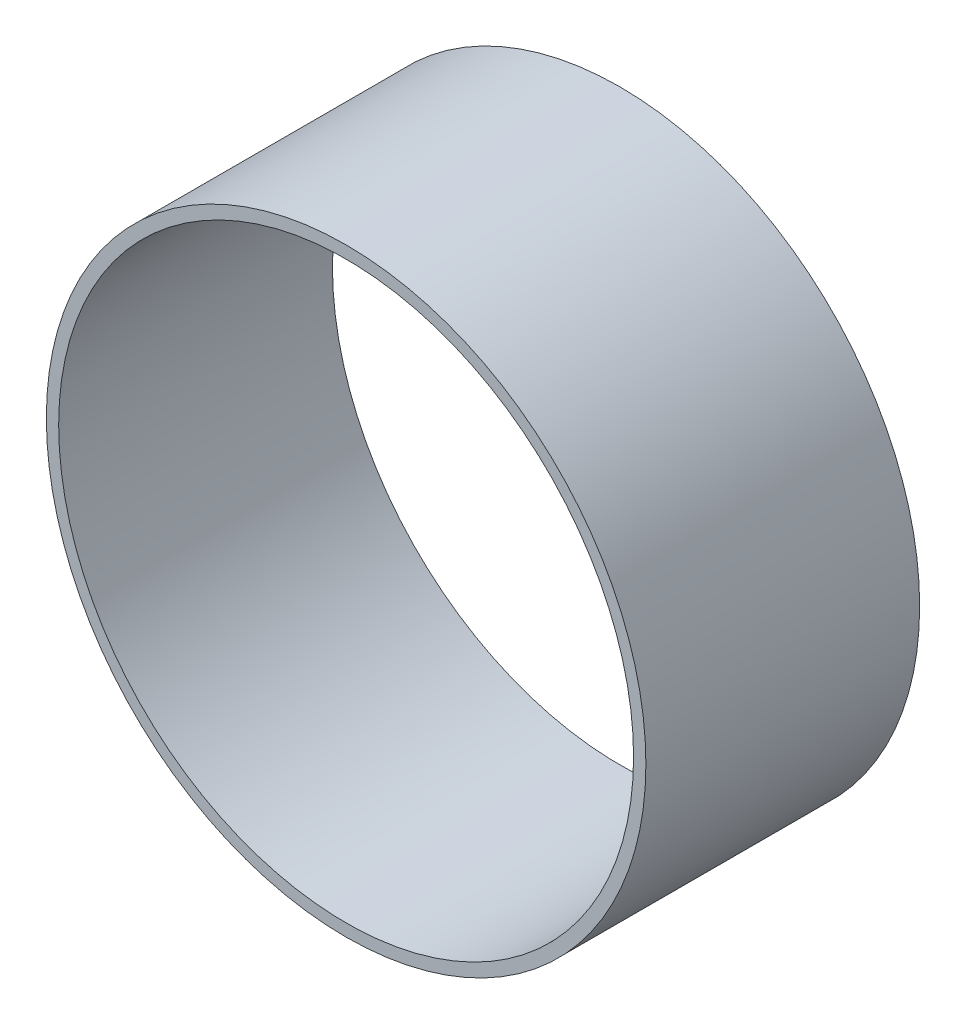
ISO-10303-21;
HEADER;
FILE_DESCRIPTION(('STEP AP214'),'2;1');
FILE_NAME('part.step','',(''),(''),'','','');
FILE_SCHEMA(('AUTOMOTIVE_DESIGN { 1 0 10303 214 1 1 1 1 }'));
ENDSEC;
DATA;
#1=APPLICATION_CONTEXT('core data for automotive mechanical design processes');
#2=APPLICATION_PROTOCOL_DEFINITION('international standard','automotive_design',2000,#1);
#3=PRODUCT_CONTEXT('',#1,'mechanical');
#4=PRODUCT('Part','Part','',(#3));
#5=PRODUCT_RELATED_PRODUCT_CATEGORY('part','',(#4));
#6=PRODUCT_DEFINITION_FORMATION('','',#4);
#7=PRODUCT_DEFINITION_CONTEXT('part definition',#1,'design');
#8=PRODUCT_DEFINITION('design','',#6,#7);
#9=PRODUCT_DEFINITION_SHAPE('','',#8);
#10=(LENGTH_UNIT() NAMED_UNIT(*) SI_UNIT(.MILLI.,.METRE.));
#11=(NAMED_UNIT(*) PLANE_ANGLE_UNIT() SI_UNIT($,.RADIAN.));
#12=(NAMED_UNIT(*) SI_UNIT($,.STERADIAN.) SOLID_ANGLE_UNIT());
#13=UNCERTAINTY_MEASURE_WITH_UNIT(LENGTH_MEASURE(1.E-05),#10,'distance_accuracy_value','');
#14=(GEOMETRIC_REPRESENTATION_CONTEXT(3) GLOBAL_UNCERTAINTY_ASSIGNED_CONTEXT((#13)) GLOBAL_UNIT_ASSIGNED_CONTEXT((#10,
#11,#12)) REPRESENTATION_CONTEXT('',''));
#15=CARTESIAN_POINT('',(0.,0.,0.));
#16=DIRECTION('',(0.,0.,1.));
#17=DIRECTION('',(1.,0.,0.));
#18=AXIS2_PLACEMENT_3D('',#15,#16,#17);
#19=CARTESIAN_POINT('',(0.,0.,409.712770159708));
#20=DIRECTION('',(0.,0.,-1.));
#21=DIRECTION('',(-1.,0.,0.));
#22=AXIS2_PLACEMENT_3D('',#19,#20,#21);
#23=CYLINDRICAL_SURFACE('',#22,109.5);
#24=CARTESIAN_POINT('',(0.,0.,0.));
#25=DIRECTION('',(0.,0.,1.));
#26=DIRECTION('',(1.,0.,0.));
#27=AXIS2_PLACEMENT_3D('',#24,#25,#26);
#28=CIRCLE('',#27,109.5);
#29=CARTESIAN_POINT('',(109.5,0.,0.));
#30=VERTEX_POINT('',#29);
#31=EDGE_CURVE('E44',#30,#30,#28,.T.);
#32=ORIENTED_EDGE('',*,*,#31,.T.);
#33=EDGE_LOOP('',(#32));
#34=FACE_BOUND('',#33,.T.);
#35=CARTESIAN_POINT('',(0.,0.,100.));
#36=DIRECTION('',(0.,0.,1.));
#37=DIRECTION('',(1.,0.,0.));
#38=AXIS2_PLACEMENT_3D('',#35,#36,#37);
#39=CIRCLE('',#38,109.5);
#40=CARTESIAN_POINT('',(109.5,0.,100.));
#41=VERTEX_POINT('',#40);
#42=EDGE_CURVE('E10',#41,#41,#39,.T.);
#43=ORIENTED_EDGE('',*,*,#42,.F.);
#44=EDGE_LOOP('',(#43));
#45=FACE_BOUND('',#44,.T.);
#46=ADVANCED_FACE('F37',(#34,#45),#23,.T.);
#47=CARTESIAN_POINT('',(0.,0.,0.));
#48=DIRECTION('',(0.,0.,1.));
#49=DIRECTION('',(1.,0.,0.));
#50=AXIS2_PLACEMENT_3D('',#47,#48,#49);
#51=PLANE('',#50);
#52=ORIENTED_EDGE('',*,*,#31,.F.);
#53=EDGE_LOOP('',(#52));
#54=FACE_BOUND('',#53,.T.);
#55=CARTESIAN_POINT('',(0.,0.,0.));
#56=DIRECTION('',(0.,0.,1.));
#57=DIRECTION('',(1.,0.,0.));
#58=AXIS2_PLACEMENT_3D('',#55,#56,#57);
#59=CIRCLE('',#58,105.);
#60=CARTESIAN_POINT('',(105.,0.,0.));
#61=VERTEX_POINT('',#60);
#62=EDGE_CURVE('E49',#61,#61,#59,.T.);
#63=ORIENTED_EDGE('',*,*,#62,.T.);
#64=EDGE_LOOP('',(#63));
#65=FACE_BOUND('',#64,.T.);
#66=ADVANCED_FACE('F65',(#54,#65),#51,.F.);
#67=CARTESIAN_POINT('',(0.,0.,409.712770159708));
#68=DIRECTION('',(0.,0.,-1.));
#69=DIRECTION('',(-1.,0.,0.));
#70=AXIS2_PLACEMENT_3D('',#67,#68,#69);
#71=CYLINDRICAL_SURFACE('',#70,105.);
#72=ORIENTED_EDGE('',*,*,#62,.F.);
#73=EDGE_LOOP('',(#72));
#74=FACE_BOUND('',#73,.T.);
#75=CARTESIAN_POINT('',(0.,0.,100.));
#76=DIRECTION('',(0.,0.,1.));
#77=DIRECTION('',(1.,0.,0.));
#78=AXIS2_PLACEMENT_3D('',#75,#76,#77);
#79=CIRCLE('',#78,105.);
#80=CARTESIAN_POINT('',(105.,0.,100.));
#81=VERTEX_POINT('',#80);
#82=EDGE_CURVE('E40',#81,#81,#79,.T.);
#83=ORIENTED_EDGE('',*,*,#82,.T.);
#84=EDGE_LOOP('',(#83));
#85=FACE_BOUND('',#84,.T.);
#86=ADVANCED_FACE('F57',(#74,#85),#71,.F.);
#87=CARTESIAN_POINT('',(0.,0.,100.));
#88=DIRECTION('',(0.,0.,1.));
#89=DIRECTION('',(1.,0.,0.));
#90=AXIS2_PLACEMENT_3D('',#87,#88,#89);
#91=PLANE('',#90);
#92=ORIENTED_EDGE('',*,*,#82,.F.);
#93=EDGE_LOOP('',(#92));
#94=FACE_BOUND('',#93,.T.);
#95=ORIENTED_EDGE('',*,*,#42,.T.);
#96=EDGE_LOOP('',(#95));
#97=FACE_BOUND('',#96,.T.);
#98=ADVANCED_FACE('F59',(#94,#97),#91,.T.);
#99=CLOSED_SHELL('',(#46,#66,#86,#98));
#100=MANIFOLD_SOLID_BREP('B2',#99);
#101=ADVANCED_BREP_SHAPE_REPRESENTATION('',(#18,#100),#14);
#102=SHAPE_DEFINITION_REPRESENTATION(#9,#101);
ENDSEC;
END-ISO-10303-21;
